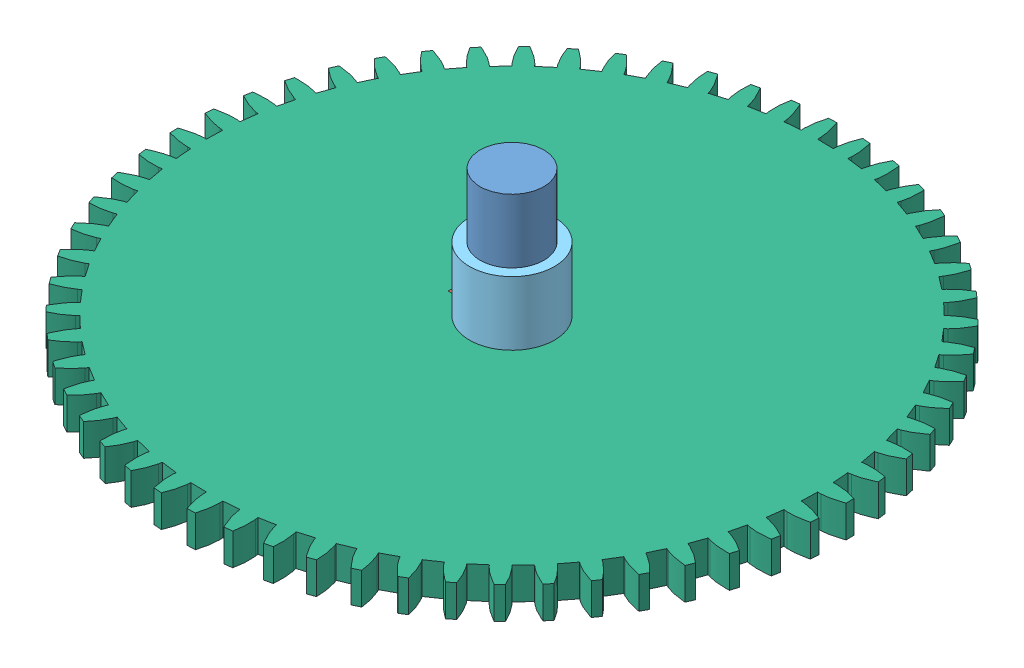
SolidWorks assembly Axle Assembly P.SLDASM, configuration Default (file format 6000). Lengths in mm.
Overall size (31 16.5 31).
7 component instances, 6 part files, 19 mates.
Components (placement in the parent):
- Axle P-1: Axle P.SLDPRT [Default] at (-16.3842 1.5557 -0.3362) size (3 16.5 3)
- Key-1: Key.SLDPRT [Default] at (-15.8842 10.5557 -0.3362) x (1 0 0) z (0 0 -1) size (2 1.5 1)
- Key-2: Key.SLDPRT [Default] at (-16.3842 10.5557 -0.3362) size (2 1.5 1)
- Gear 12T-1: Gear 12T.sldprt [Default] at (-14.8842 9.0557 -0.3362) x (0 0 -1) z (1 0 0) size (6.99 1.5 6.99)
- Spacer 4.5mm-1: Spacer 4.5mm.SLDPRT [Default] at (-14.8842 4.5557 -0.3362) x (0 0 -1) z (1 0 0) size (4 4.5 4)
- Spacer 3mm-1: Spacer 3mm.SLDPRT [Default] at (-14.8842 12.0557 -0.3362) x (0 0 1) z (-1 0 0) size (4 3 4)
- Gear 60T-2: Gear 60T.sldprt [Default] at (-14.8842 10.5557 -0.3362) x (0 0 -1) z (1 0 0) size (31 1.5 31)
Mates (geometry in assembly coordinates):
- Coincident1: coincident anti-aligned: plane of Axle P-1 through (-15.3842 12.0557 -0.8362) normal (0 -1 0); plane of Key-2 through (-16.3842 12.0557 -0.3362) normal (0 1 0)
- Coincident2: coincident anti-aligned: plane of Axle P-1 through (-15.3842 9.0557 -0.8362) normal (0 0 1); plane of Key-2 through (-17.3842 12.0557 -0.8362) normal (0 0 -1)
- Coincident3: coincident anti-aligned: plane of Axle P-1 through (-15.3842 12.0557 -0.8362) normal (0 -1 0); plane of Key-2 through (-16.3842 12.0557 -0.3362) normal (0 1 0)
- Coincident4: coincident anti-aligned: plane of Axle P-1 through (-15.3842 1.5557 -0.3362) normal (-1 0 0); plane of Key-2 through (-15.3842 12.0557 0.1638) normal (1 0 0)
- Coincident5: coincident anti-aligned: plane of Axle P-1 through (-15.3842 9.0557 -0.8362) normal (0 1 0); plane of Key-1 through (-15.8842 9.0557 -0.3362) normal (0 -1 0)
- Coincident6: coincident anti-aligned: plane of Axle P-1 through (-15.3842 9.0557 -0.8362) normal (0 0 1); plane of Key-1 through (-16.8842 9.0557 -0.8362) normal (0 0 -1)
- Coincident7: coincident anti-aligned: plane of Axle P-1 through (-14.8842 1.5557 -0.3362) normal (-1 0 0); plane of Key-1 through (-14.8842 9.0557 -0.8362) normal (1 0 0)
- Concentric5: concentric aligned: cylinder of Axle P-1 through (-14.8842 18.0557 -0.3362) axis (0 -1 0) radius 1.5; cylinder of Spacer 3mm-1 through (-14.8842 15.0557 -0.3362) axis (0 -1 0) radius 1.5
- Parallel3: parallel anti-aligned: line of Key-2 through (-17.3842 12.0557 0.1638) axis (1 0 0); line of Spacer 3mm-1 through (-14.8842 12.0557 -0.3362) axis (-1 0 0)
- Concentric6: concentric aligned: cylinder of Axle P-1 through (-14.8842 18.0557 -0.3362) axis (0 -1 0) radius 1.5; cylinder of Spacer 4.5mm-1 through (-14.8842 9.0557 -0.3362) axis (0 -1 0) radius 1.5
- Parallel4: parallel anti-aligned: line of Spacer 4.5mm-1 through (-14.8842 4.5557 -0.3362) axis (1 0 0); line of Spacer 3mm-1 through (-14.8842 12.0557 -0.3362) axis (-1 0 0)
- Coincident8: coincident anti-aligned: plane of Key-2 through (-16.3842 12.0557 -0.3362) normal (0 1 0); plane of Spacer 3mm-1 through (-14.8842 12.0557 -0.3362) normal (0 -1 0)
- Coincident9: coincident anti-aligned: plane of Key-1 through (-15.8842 9.0557 -0.3362) normal (0 -1 0); plane of Spacer 4.5mm-1 through (-14.8842 9.0557 -0.3362) normal (0 1 0)
- Coincident10: coincident aligned: plane of Key-1 through (-15.8842 9.0557 -0.3362) normal (0 -1 0); plane of Gear 12T-1 through (-13.4755 9.0557 4.2106) normal (0 -1 0)
- Concentric7: concentric aligned: cylinder of Axle P-1 through (-14.8842 18.0557 -0.3362) axis (0 -1 0) radius 1.5; cylinder of Gear 12T-1 through (-14.8842 10.5557 -0.3362) axis (0 -1 0) radius 1.5
- Parallel5: parallel anti-aligned: line of Key-1 through (-16.8842 9.0557 0.1638) axis (0 0 -1); line of Gear 12T-1 through (-16.8842 10.5557 -0.8362) axis (0 0 1)
- Coincident12: coincident aligned: plane of Key-2 through (-16.3842 12.0557 -0.3362) normal (0 1 0); plane of Gear 60T-2 through (-9.5311 12.0557 20.4272) normal (0 1 0)
- Concentric8: concentric aligned: cylinder of Axle P-1 through (-14.8842 18.0557 -0.3362) axis (0 -1 0) radius 1.5; cylinder of Gear 60T-2 through (-14.8842 12.0557 -0.3362) axis (0 -1 0) radius 1.5
- Parallel6: parallel aligned: line of Key-2 through (-17.3842 12.0557 -0.8362) axis (0 0 1); line of Gear 60T-2 through (-17.3842 12.0557 -0.8362) axis (0 0 1)
